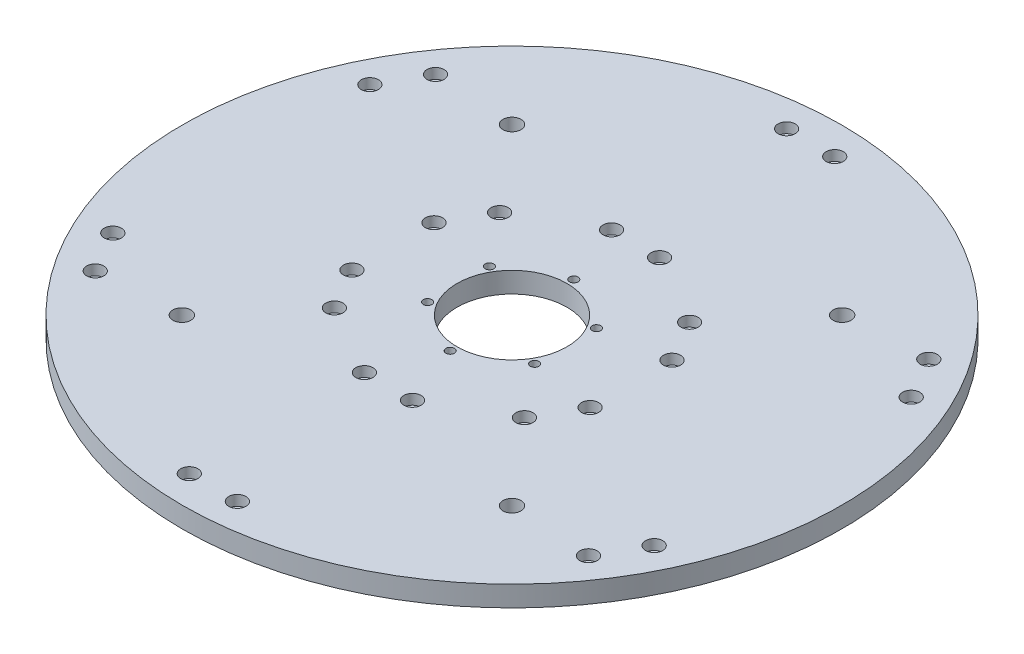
from build123d import *

# Parameters (mm, degrees)
SKETCH1_R                                        = 304.8
SKETCH1_R_2                                      = 50.8
EXTRUDE1_DEPTH                                   = 19.05
CBORE_FOR_3_8_SOCKET_HEAD_CAP_SCREW1_D           = 10.0838
CBORE_FOR_3_8_SOCKET_HEAD_CAP_SCREW1_CBORE_D     = 15.875
CBORE_FOR_3_8_SOCKET_HEAD_CAP_SCREW1_CBORE_DEPTH = 9.525
CIRPATTERN1_COUNT                                = 6
F_5_8_CLEARANCE_HOLE1_D                          = 16.66748
CIRPATTERN2_COUNT                                = 4
F_5_16_0_3125_DIAMETER_HOLE1_D                   = 7.9375


with BuildPart() as part:
    # Sketch1 → Extrude1 (new body)
    with BuildSketch(Plane(origin=(0, 0, 0), x_dir=(1, 0, 0), z_dir=(0, 1, 0))):
        with Locations(Location((0, 0, 0), (0, 0, 90))):
            Circle(SKETCH1_R)
        with Locations(Location((0, 0, 0), (0, 0, 90))):
            Circle(SKETCH1_R_2, mode=Mode.SUBTRACT)
    extrude(amount=EXTRUDE1_DEPTH)

    # CBORE for 3_8 Socket Head Cap Screw1 (through all)
    with Locations(Plane(origin=(0, 19.05, 0), x_dir=(-1, 0, 0), z_dir=(0, 1, 0))):
        with Locations((-22.225, 114.3), (22.225, 276.225), (-22.225, 276.225), (22.225, 114.3)):
            cbore_for_3_8_socket_head_cap_screw1 = CounterBoreHole(CBORE_FOR_3_8_SOCKET_HEAD_CAP_SCREW1_D / 2, CBORE_FOR_3_8_SOCKET_HEAD_CAP_SCREW1_CBORE_D / 2, CBORE_FOR_3_8_SOCKET_HEAD_CAP_SCREW1_CBORE_DEPTH)

    # CirPattern1: CBORE for 3_8 Socket Head Cap Screw1 ×6 about axis
    cirpattern1_axis = Axis((0, 0, 0), (0, 1, 0))
    for i in range(1, CIRPATTERN1_COUNT):
        add(cbore_for_3_8_socket_head_cap_screw1.rotate(cirpattern1_axis, i * 360 / CIRPATTERN1_COUNT), mode=Mode.SUBTRACT)

    # 5_8 Clearance Hole1 (through all)
    with Locations(Plane(origin=(0, 19.05, 0), x_dir=(-1, 0, 0), z_dir=(0, 1, 0))):
        with Locations((152.664354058, -152.664354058)):
            f_5_8_clearance_hole1 = Hole(F_5_8_CLEARANCE_HOLE1_D / 2)

    # CirPattern2: 5_8 Clearance Hole1 ×4 about axis
    cirpattern2_axis = Axis((0, 0, 0), (0, 1, 0))
    for i in range(1, CIRPATTERN2_COUNT):
        add(f_5_8_clearance_hole1.rotate(cirpattern2_axis, i * 360 / CIRPATTERN2_COUNT), mode=Mode.SUBTRACT)

    # 5_16 _0.3125_ Diameter Hole1 (through all)
    with Locations(Plane(origin=(0, 19.05, 0), x_dir=(-1, 0, 0), z_dir=(0, 1, 0))):
        with Locations((0, -57.15), (-49.493351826, -28.575), (-49.493351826, 28.575), (0, 57.15), (49.493351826, 28.575), (49.493351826, -28.575)):
            Hole(F_5_16_0_3125_DIAMETER_HOLE1_D / 2)


solid = part.part
